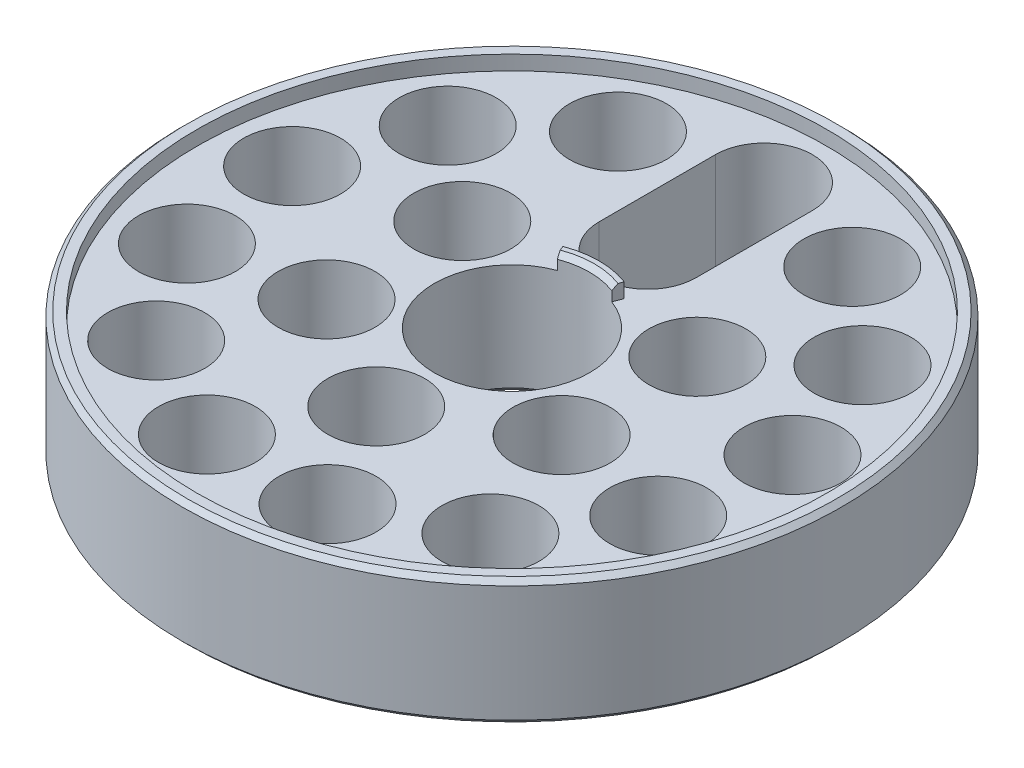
from build123d import *

# Parameters (mm, degrees)
SKETCH1_R           = 34
SKETCH1_R_2         = 8
BOSS_EXTRUDE1_DEPTH = 13
SKETCH2_R           = 32.5
CUT_EXTRUDE1_DEPTH  = 1.5
CHAMFER1_SIZE       = 0.5
SKETCH3_R           = 5
CUT_EXTRUDE2_DEPTH  = 10
SKETCH4_R           = 5
CUT_EXTRUDE3_DEPTH  = 50.439356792


with BuildPart() as part:
    # Sketch1 → Boss-Extrude1 (new body)
    with BuildSketch(Plane(origin=(0, 0, 0), x_dir=(1, 0, 0), z_dir=(0, 1, 0))):
        with Locations(Location((0, 0, 0), (0, 0, 270))):
            Circle(SKETCH1_R)
        with Locations(Location((0, 0, 0), (0, 0, 270))):
            Circle(SKETCH1_R_2, mode=Mode.SUBTRACT)
    extrude(amount=-BOSS_EXTRUDE1_DEPTH)

    # Sketch2 → Cut-Extrude1 (cut)
    with BuildSketch(Plane(origin=(0, 0, 0), x_dir=(1, 0, 0), z_dir=(0, 1, 0))):
        with Locations(Location((0, 0, 0), (0, 0, 270))):
            Circle(SKETCH2_R)
        with BuildLine():
            Line((2.808987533, 7.490633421), (3, 8))
            Line((3, 8), (3.160110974, 8.426962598))
            ThreePointArc((3.160110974, 8.426962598), (0, 9), (-3.160110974, 8.426962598))
            Line((-3.160110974, 8.426962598), (-3, 8))
            Line((-3, 8), (-2.808987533, 7.490633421))
            ThreePointArc((-2.808987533, 7.490633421), (0, -8), (2.808987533, 7.490633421))
        make_face(mode=Mode.SUBTRACT)
    extrude(amount=-CUT_EXTRUDE1_DEPTH, mode=Mode.SUBTRACT)

    # Chamfer1
    chamfer1_edges = [part.edges().sort_by_distance(p)[0] for p in [
        (0, 0, -34),
        (0, -13, -34),
        (0, -13, -8),
        (0, 0, -8),
    ]]
    chamfer(chamfer1_edges, length=CHAMFER1_SIZE)

    # Sketch3 → Cut-Extrude2 (cut)
    with BuildSketch(Plane(origin=(0, -1.5, 0), x_dir=(1, 0, 0), z_dir=(0, 1, 0))):
        with Locations(Location((12.082802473, 23.021856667, 0), (0, 0, 270))):
            Circle(SKETCH3_R)
        with Locations(Location((21.397580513, 14.769683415, 0), (0, 0, 270))):
            Circle(SKETCH3_R)
        with Locations(Location((25.810430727, 3.133953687, 0), (0, 0, 270))):
            Circle(SKETCH3_R)
        with Locations(Location((24.31042231, -9.219727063, 0), (0, 0, 270))):
            Circle(SKETCH3_R)
        with Locations(Location((17.241189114, -19.461279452, 0), (0, 0, 270))):
            Circle(SKETCH3_R)
        with Locations(Location((6.222207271, -25.244487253, 0), (0, 0, 270))):
            Circle(SKETCH3_R)
        with Locations(Location((-6.222207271, -25.244487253, 0), (0, 0, 270))):
            Circle(SKETCH3_R)
        with Locations(Location((-17.241189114, -19.461279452, 0), (0, 0, 270))):
            Circle(SKETCH3_R)
        with Locations(Location((-24.31042231, -9.219727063, 0), (0, 0, 270))):
            Circle(SKETCH3_R)
        with Locations(Location((-25.810430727, 3.133953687, 0), (0, 0, 270))):
            Circle(SKETCH3_R)
        with Locations(Location((-21.397580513, 14.769683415, 0), (0, 0, 270))):
            Circle(SKETCH3_R)
        with Locations(Location((-12.082802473, 23.021856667, 0), (0, 0, 270))):
            Circle(SKETCH3_R)
        with Locations(Location((12.124355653, 7, 0), (0, 0, 270))):
            Circle(SKETCH3_R)
        with Locations(Location((12.124355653, -7, 0), (0, 0, 270))):
            Circle(SKETCH3_R)
        with Locations(Location((0, -14, 0), (0, 0, 270))):
            Circle(SKETCH3_R)
        with Locations(Location((-12.124355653, -7, 0), (0, 0, 270))):
            Circle(SKETCH3_R)
        with Locations(Location((-12.124355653, 7, 0), (0, 0, 270))):
            Circle(SKETCH3_R)
        with BuildLine():
            Line((-5, 26), (-5, 14))
            ThreePointArc((-5, 14), (0, 9), (5, 14))
            Line((5, 14), (5, 26))
            ThreePointArc((5, 26), (0, 31), (-5, 26))
        make_face()
    extrude(amount=-CUT_EXTRUDE2_DEPTH, mode=Mode.SUBTRACT)

    # Sketch4 → Cut-Extrude3 (cut, through all)
    with BuildSketch(Plane(origin=(0, -11.5, 0), x_dir=(1, 0, 0), z_dir=(0, 1, 0))):
        with Locations(Location((0, 14, 0), (0, 0, 270))):
            Circle(SKETCH4_R)
    extrude(amount=-CUT_EXTRUDE3_DEPTH, mode=Mode.SUBTRACT)


solid = part.part
